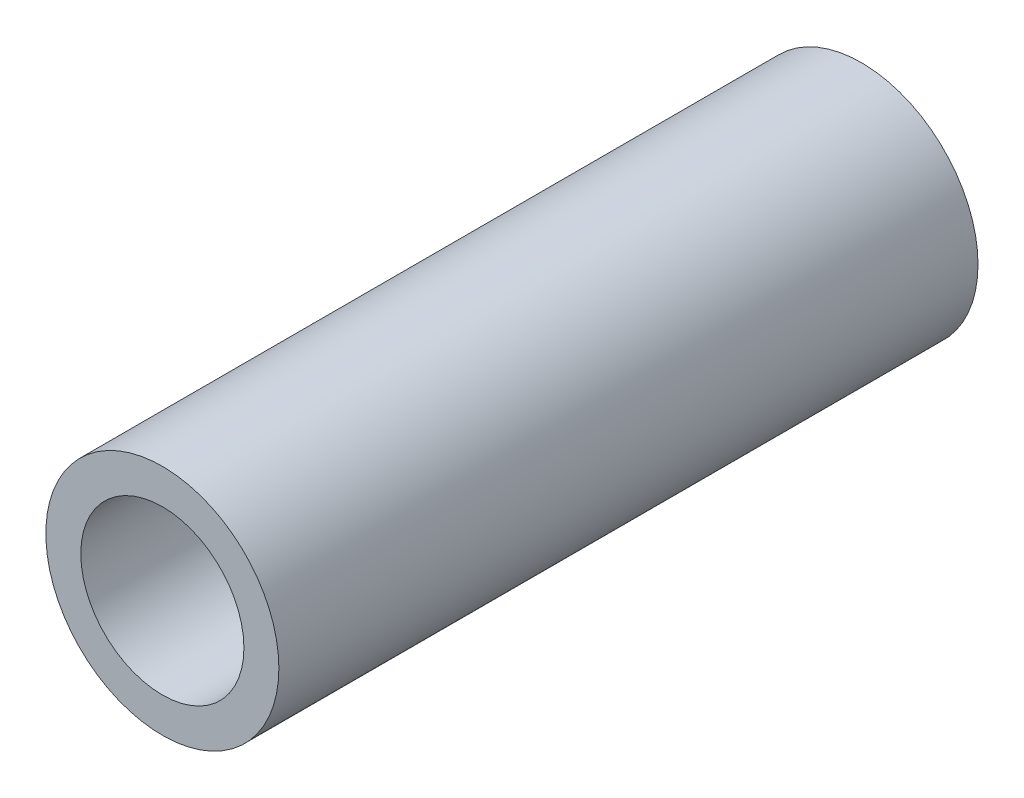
from build123d import *

# Parameters (mm, degrees)
SKIZZE1_R                       = 10
SKIZZE1_R_2                     = 7
AUFSATZ_LINEAR_AUSTRAGEN1_DEPTH = 60


with BuildPart() as part:
    # Skizze1 → Aufsatz-Linear austragen1 (new body)
    with BuildSketch(Plane.XY):
        Circle(SKIZZE1_R)
        Circle(SKIZZE1_R_2, mode=Mode.SUBTRACT)
    extrude(amount=AUFSATZ_LINEAR_AUSTRAGEN1_DEPTH)


solid = part.part
